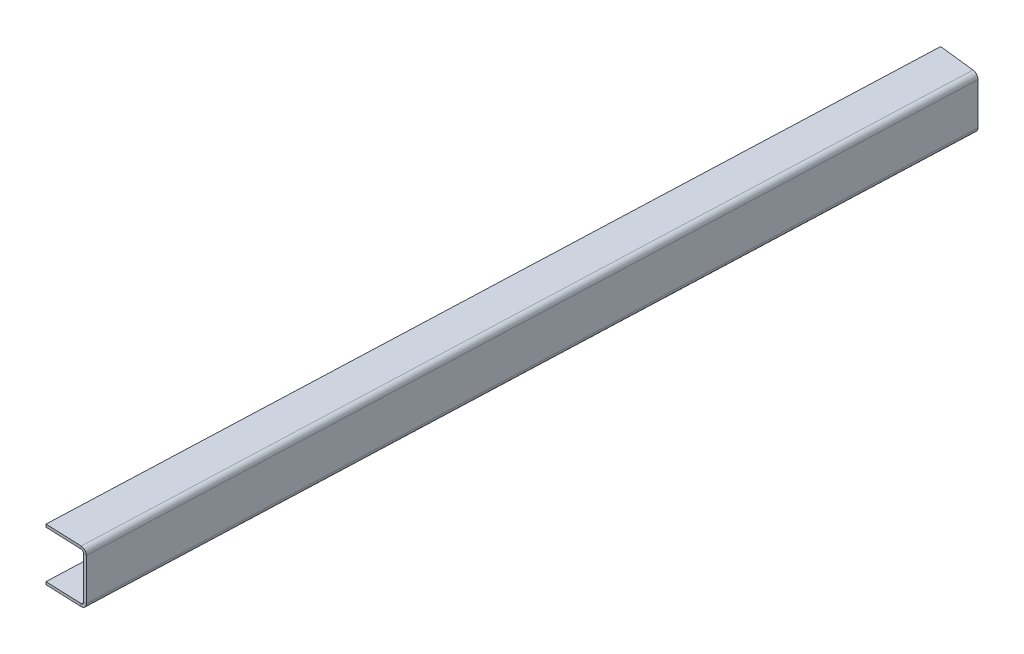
ISO-10303-21;
HEADER;
FILE_DESCRIPTION(('STEP AP214'),'2;1');
FILE_NAME('part.step','',(''),(''),'','','');
FILE_SCHEMA(('AUTOMOTIVE_DESIGN { 1 0 10303 214 1 1 1 1 }'));
ENDSEC;
DATA;
#1=APPLICATION_CONTEXT('core data for automotive mechanical design processes');
#2=APPLICATION_PROTOCOL_DEFINITION('international standard','automotive_design',2000,#1);
#3=PRODUCT_CONTEXT('',#1,'mechanical');
#4=PRODUCT('Part','Part','',(#3));
#5=PRODUCT_RELATED_PRODUCT_CATEGORY('part','',(#4));
#6=PRODUCT_DEFINITION_FORMATION('','',#4);
#7=PRODUCT_DEFINITION_CONTEXT('part definition',#1,'design');
#8=PRODUCT_DEFINITION('design','',#6,#7);
#9=PRODUCT_DEFINITION_SHAPE('','',#8);
#10=(LENGTH_UNIT() NAMED_UNIT(*) SI_UNIT(.MILLI.,.METRE.));
#11=(NAMED_UNIT(*) PLANE_ANGLE_UNIT() SI_UNIT($,.RADIAN.));
#12=(NAMED_UNIT(*) SI_UNIT($,.STERADIAN.) SOLID_ANGLE_UNIT());
#13=UNCERTAINTY_MEASURE_WITH_UNIT(LENGTH_MEASURE(1.E-05),#10,'distance_accuracy_value','');
#14=(GEOMETRIC_REPRESENTATION_CONTEXT(3) GLOBAL_UNCERTAINTY_ASSIGNED_CONTEXT((#13)) GLOBAL_UNIT_ASSIGNED_CONTEXT((#10,
#11,#12)) REPRESENTATION_CONTEXT('',''));
#15=CARTESIAN_POINT('',(0.,0.,0.));
#16=DIRECTION('',(0.,0.,1.));
#17=DIRECTION('',(1.,0.,0.));
#18=AXIS2_PLACEMENT_3D('',#15,#16,#17);
#19=CARTESIAN_POINT('',(-699.617156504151,0.,-689.099239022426));
#20=DIRECTION('',(0.0392134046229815,0.,-0.999230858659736));
#21=DIRECTION('',(0.,1.,0.));
#22=AXIS2_PLACEMENT_3D('',#19,#20,#21);
#23=PLANE('',#22);
#24=DIRECTION('',(-0.999230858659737,0.,-0.0392134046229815));
#25=VECTOR('',#24,1.);
#26=CARTESIAN_POINT('',(-699.617156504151,-28.4988000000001,-689.099239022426));
#27=LINE('',#26,#25);
#28=CARTESIAN_POINT('',(-697.992806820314,-28.4988000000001,-689.035493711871));
#29=VERTEX_POINT('',#28);
#30=CARTESIAN_POINT('',(-699.617156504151,-28.4988000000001,-689.099239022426));
#31=VERTEX_POINT('',#30);
#32=EDGE_CURVE('E12',#29,#31,#27,.T.);
#33=ORIENTED_EDGE('',*,*,#32,.F.);
#34=DIRECTION('',(0.,1.,0.));
#35=VECTOR('',#34,1.);
#36=CARTESIAN_POINT('',(-697.992806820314,0.,-689.035493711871));
#37=LINE('',#36,#35);
#38=CARTESIAN_POINT('',(-697.992806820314,-3.25120000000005,-689.035493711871));
#39=VERTEX_POINT('',#38);
#40=EDGE_CURVE('E137',#29,#39,#37,.T.);
#41=ORIENTED_EDGE('',*,*,#40,.T.);
#42=DIRECTION('',(-0.999230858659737,0.,-0.0392134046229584));
#43=VECTOR('',#42,1.);
#44=CARTESIAN_POINT('',(-699.617156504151,-3.25120000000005,-689.099239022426));
#45=LINE('',#44,#43);
#46=CARTESIAN_POINT('',(-699.617156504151,-3.25120000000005,-689.099239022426));
#47=VERTEX_POINT('',#46);
#48=EDGE_CURVE('E90',#39,#47,#45,.T.);
#49=ORIENTED_EDGE('',*,*,#48,.T.);
#50=DIRECTION('',(0.,1.,0.));
#51=VECTOR('',#50,1.);
#52=CARTESIAN_POINT('',(-699.617156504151,0.,-689.099239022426));
#53=LINE('',#52,#51);
#54=EDGE_CURVE('E139',#31,#47,#53,.T.);
#55=ORIENTED_EDGE('',*,*,#54,.F.);
#56=EDGE_LOOP('',(#33,#41,#49,#55));
#57=FACE_BOUND('',#56,.T.);
#58=ADVANCED_FACE('F78',(#57),#23,.F.);
#59=CARTESIAN_POINT('',(-702.865784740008,-3.25120000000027,-689.228542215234));
#60=CARTESIAN_POINT('',(-703.407234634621,-3.25120000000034,-689.249790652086));
#61=CARTESIAN_POINT('',(-703.948684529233,-3.25120000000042,-689.271039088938));
#62=CARTESIAN_POINT('',(-704.490134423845,-3.25120000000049,-689.29228752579));
#63=CARTESIAN_POINT('',(-702.865784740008,-6.50240000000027,-689.228542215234));
#64=CARTESIAN_POINT('',(-703.40723463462,-7.58613333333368,-689.249790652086));
#65=CARTESIAN_POINT('',(-703.948684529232,-8.66986666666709,-689.271039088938));
#66=CARTESIAN_POINT('',(-704.490134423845,-9.75360000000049,-689.29228752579));
#67=CARTESIAN_POINT('',(-699.617156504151,-6.50239999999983,-689.099239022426));
#68=CARTESIAN_POINT('',(-699.075706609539,-7.58613333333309,-689.077990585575));
#69=CARTESIAN_POINT('',(-698.534256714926,-8.66986666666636,-689.056742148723));
#70=CARTESIAN_POINT('',(-697.992806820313,-9.75359999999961,-689.035493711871));
#71=CARTESIAN_POINT('',(-699.617156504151,-3.25119999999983,-689.099239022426));
#72=CARTESIAN_POINT('',(-699.075706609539,-3.25119999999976,-689.077990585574));
#73=CARTESIAN_POINT('',(-698.534256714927,-3.25119999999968,-689.056742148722));
#74=CARTESIAN_POINT('',(-697.992806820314,-3.25119999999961,-689.035493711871));
#75=CARTESIAN_POINT('',(-699.617156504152,1.70436581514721E-13,-689.099239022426));
#76=CARTESIAN_POINT('',(-699.07570660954,1.08373333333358,-689.077990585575));
#77=CARTESIAN_POINT('',(-698.534256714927,2.16746666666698,-689.056742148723));
#78=CARTESIAN_POINT('',(-697.992806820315,3.25120000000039,-689.035493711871));
#79=CARTESIAN_POINT('',(-702.865784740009,-2.69315819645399E-13,-689.228542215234));
#80=CARTESIAN_POINT('',(-703.407234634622,1.08373333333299,-689.249790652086));
#81=CARTESIAN_POINT('',(-703.948684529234,2.16746666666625,-689.271039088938));
#82=CARTESIAN_POINT('',(-704.490134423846,3.25119999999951,-689.29228752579));
#83=CARTESIAN_POINT('',(-702.865784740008,-3.25120000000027,-689.228542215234));
#84=CARTESIAN_POINT('',(-703.407234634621,-3.25120000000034,-689.249790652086));
#85=CARTESIAN_POINT('',(-703.948684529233,-3.25120000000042,-689.271039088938));
#86=CARTESIAN_POINT('',(-704.490134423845,-3.25120000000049,-689.29228752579));
#87=(BOUNDED_SURFACE() B_SPLINE_SURFACE(3,3,((#59,#60,#61,#62),(#63,#64,#65,#66),(#67,#68,#69,
#70),(#71,#72,#73,#74),(#75,#76,#77,#78),(#79,#80,#81,#82),(#83,#84,#85,#86)),.UNSPECIFIED.,.T.,
.F.,.F.) B_SPLINE_SURFACE_WITH_KNOTS((4,3,4),(4,4),(0.,0.5,1.),(0.,1.),
.UNSPECIFIED.) GEOMETRIC_REPRESENTATION_ITEM() RATIONAL_B_SPLINE_SURFACE(((1.,1.,1.,1.),
(0.333333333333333,0.333333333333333,0.333333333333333,0.333333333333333),(0.333333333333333,
0.333333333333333,0.333333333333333,0.333333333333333),(1.,1.,1.,1.),(0.333333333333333,
0.333333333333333,0.333333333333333,0.333333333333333),(0.333333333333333,0.333333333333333,
0.333333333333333,0.333333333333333),(1.,1.,1.,1.))) REPRESENTATION_ITEM('') SURFACE());
#88=CARTESIAN_POINT('',(-701.24147062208,-3.25120000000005,-689.16389061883));
#89=DIRECTION('',(-0.0394921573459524,0.,0.999219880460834));
#90=DIRECTION('',(-0.999219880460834,-1.35258484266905E-13,-0.0394921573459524));
#91=AXIS2_PLACEMENT_3D('',#88,#89,#90);
#92=ELLIPSE('',#91,3.25120012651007,3.2512);
#93=CARTESIAN_POINT('',(-701.24147062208,0.,-689.16389061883));
#94=VERTEX_POINT('',#93);
#95=EDGE_CURVE('E215',#39,#94,#92,.T.);
#96=DIRECTION('',(0.,-1.,0.));
#97=VECTOR('',#96,1.);
#98=CARTESIAN_POINT('',(-701.24147062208,-1.62560000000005,-689.16389061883));
#99=LINE('',#98,#97);
#100=CARTESIAN_POINT('',(-701.24147062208,-1.62560000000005,-689.16389061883));
#101=VERTEX_POINT('',#100);
#102=EDGE_CURVE('E205',#94,#101,#99,.T.);
#103=CARTESIAN_POINT('',(-701.24147062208,-3.25120000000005,-689.16389061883));
#104=DIRECTION('',(-0.0397709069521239,0.,0.999208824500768));
#105=DIRECTION('',(-0.999208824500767,-1.35321803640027E-13,-0.0397709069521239));
#106=AXIS2_PLACEMENT_3D('',#103,#104,#105);
#107=ELLIPSE('',#106,1.62560025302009,1.6256);
#108=EDGE_CURVE('E213',#47,#101,#107,.T.);
#109=ORIENTED_EDGE('',*,*,#48,.F.);
#110=ORIENTED_EDGE('',*,*,#95,.T.);
#111=ORIENTED_EDGE('',*,*,#102,.T.);
#112=ORIENTED_EDGE('',*,*,#108,.F.);
#113=EDGE_LOOP('',(#109,#110,#111,#112));
#114=FACE_BOUND('',#113,.T.);
#115=ADVANCED_FACE('F212',(#114),#87,.F.);
#116=CARTESIAN_POINT('',(-723.377141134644,-1.62560000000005,-690.044943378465));
#117=DIRECTION('',(-0.0397709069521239,0.,0.999208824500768));
#118=DIRECTION('',(0.999208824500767,0.,0.0397709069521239));
#119=AXIS2_PLACEMENT_3D('',#116,#117,#118);
#120=PLANE('',#119);
#121=ORIENTED_EDGE('',*,*,#102,.F.);
#122=DIRECTION('',(0.999208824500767,0.,0.0397709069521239));
#123=VECTOR('',#122,1.);
#124=CARTESIAN_POINT('',(-723.377141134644,0.,-690.044943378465));
#125=LINE('',#124,#123);
#126=CARTESIAN_POINT('',(-723.377141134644,0.,-690.044943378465));
#127=VERTEX_POINT('',#126);
#128=EDGE_CURVE('E176',#127,#94,#125,.T.);
#129=ORIENTED_EDGE('',*,*,#128,.F.);
#130=DIRECTION('',(0.,-1.,0.));
#131=VECTOR('',#130,1.);
#132=CARTESIAN_POINT('',(-723.377141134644,-1.62560000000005,-690.044943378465));
#133=LINE('',#132,#131);
#134=CARTESIAN_POINT('',(-723.377141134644,-1.62560000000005,-690.044943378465));
#135=VERTEX_POINT('',#134);
#136=EDGE_CURVE('E202',#127,#135,#133,.T.);
#137=ORIENTED_EDGE('',*,*,#136,.T.);
#138=DIRECTION('',(0.999208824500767,0.,0.0397709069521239));
#139=VECTOR('',#138,1.);
#140=CARTESIAN_POINT('',(-723.377141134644,-1.62560000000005,-690.044943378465));
#141=LINE('',#140,#139);
#142=EDGE_CURVE('E232',#135,#101,#141,.T.);
#143=ORIENTED_EDGE('',*,*,#142,.T.);
#144=EDGE_LOOP('',(#121,#129,#137,#143));
#145=FACE_BOUND('',#144,.T.);
#146=ADVANCED_FACE('F233',(#145),#120,.T.);
#147=CARTESIAN_POINT('',(-702.947894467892,-1.62560000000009,-1210.6203406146));
#148=DIRECTION('',(-0.999230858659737,0.,-0.0392134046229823));
#149=DIRECTION('',(-0.0392134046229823,0.,0.999230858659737));
#150=AXIS2_PLACEMENT_3D('',#147,#148,#149);
#151=PLANE('',#150);
#152=ORIENTED_EDGE('',*,*,#136,.F.);
#153=DIRECTION('',(-0.0392134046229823,0.,0.999230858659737));
#154=VECTOR('',#153,1.);
#155=CARTESIAN_POINT('',(-702.947894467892,0.,-1210.6203406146));
#156=LINE('',#155,#154);
#157=CARTESIAN_POINT('',(-702.947894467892,0.,-1210.6203406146));
#158=VERTEX_POINT('',#157);
#159=EDGE_CURVE('E168',#158,#127,#156,.T.);
#160=ORIENTED_EDGE('',*,*,#159,.F.);
#161=DIRECTION('',(0.,-1.,0.));
#162=VECTOR('',#161,1.);
#163=CARTESIAN_POINT('',(-702.947894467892,-1.62560000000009,-1210.6203406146));
#164=LINE('',#163,#162);
#165=CARTESIAN_POINT('',(-702.947894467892,-1.62560000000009,-1210.6203406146));
#166=VERTEX_POINT('',#165);
#167=EDGE_CURVE('E199',#158,#166,#164,.T.);
#168=ORIENTED_EDGE('',*,*,#167,.T.);
#169=DIRECTION('',(-0.0392134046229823,0.,0.999230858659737));
#170=VECTOR('',#169,1.);
#171=CARTESIAN_POINT('',(-702.947894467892,-1.62560000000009,-1210.6203406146));
#172=LINE('',#171,#170);
#173=EDGE_CURVE('E237',#166,#135,#172,.T.);
#174=ORIENTED_EDGE('',*,*,#173,.T.);
#175=EDGE_LOOP('',(#152,#160,#168,#174));
#176=FACE_BOUND('',#175,.T.);
#177=ADVANCED_FACE('F280',(#176),#151,.T.);
#178=CARTESIAN_POINT('',(-677.64081354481,-1.62560000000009,-1207.75438699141));
#179=DIRECTION('',(0.112527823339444,0.,-0.993648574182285));
#180=DIRECTION('',(-0.993648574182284,0.,-0.112527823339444));
#181=AXIS2_PLACEMENT_3D('',#178,#179,#180);
#182=PLANE('',#181);
#183=ORIENTED_EDGE('',*,*,#167,.F.);
#184=DIRECTION('',(-0.993648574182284,0.,-0.112527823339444));
#185=VECTOR('',#184,1.);
#186=CARTESIAN_POINT('',(-677.64081354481,0.,-1207.75438699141));
#187=LINE('',#186,#185);
#188=CARTESIAN_POINT('',(-680.875741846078,0.,-1208.12073325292));
#189=VERTEX_POINT('',#188);
#190=EDGE_CURVE('E173',#189,#158,#187,.T.);
#191=ORIENTED_EDGE('',*,*,#190,.F.);
#192=DIRECTION('',(0.,-1.,0.));
#193=VECTOR('',#192,1.);
#194=CARTESIAN_POINT('',(-680.875741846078,-1.62560000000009,-1208.12073325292));
#195=LINE('',#194,#193);
#196=CARTESIAN_POINT('',(-680.875741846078,-1.62560000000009,-1208.12073325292));
#197=VERTEX_POINT('',#196);
#198=EDGE_CURVE('E196',#189,#197,#195,.T.);
#199=ORIENTED_EDGE('',*,*,#198,.T.);
#200=DIRECTION('',(-0.993648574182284,0.,-0.112527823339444));
#201=VECTOR('',#200,1.);
#202=CARTESIAN_POINT('',(-677.64081354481,-1.62560000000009,-1207.75438699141));
#203=LINE('',#202,#201);
#204=EDGE_CURVE('E238',#197,#166,#203,.T.);
#205=ORIENTED_EDGE('',*,*,#204,.T.);
#206=EDGE_LOOP('',(#183,#191,#199,#205));
#207=FACE_BOUND('',#206,.T.);
#208=ADVANCED_FACE('F307',(#207),#182,.T.);
#209=CARTESIAN_POINT('',(-682.495395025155,-3.25120000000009,-1208.3041542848));
#210=CARTESIAN_POINT('',(-683.036844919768,-3.25120000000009,-1208.32540272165));
#211=CARTESIAN_POINT('',(-683.57829481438,-3.25120000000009,-1208.3466511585));
#212=CARTESIAN_POINT('',(-684.119744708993,-3.25120000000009,-1208.36789959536));
#213=CARTESIAN_POINT('',(-682.495395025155,0.,-1208.3041542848));
#214=CARTESIAN_POINT('',(-683.036844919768,1.08373333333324,-1208.32540272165));
#215=CARTESIAN_POINT('',(-683.578294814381,2.16746666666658,-1208.3466511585));
#216=CARTESIAN_POINT('',(-684.119744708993,3.25119999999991,-1208.36789959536));
#217=CARTESIAN_POINT('',(-679.256088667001,0.,-1207.93731222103));
#218=CARTESIAN_POINT('',(-678.714638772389,1.08373333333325,-1207.91606378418));
#219=CARTESIAN_POINT('',(-678.173188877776,2.16746666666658,-1207.89481534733));
#220=CARTESIAN_POINT('',(-677.631738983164,3.25119999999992,-1207.87356691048));
#221=CARTESIAN_POINT('',(-679.256088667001,-3.25120000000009,-1207.93731222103));
#222=CARTESIAN_POINT('',(-678.714638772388,-3.25120000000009,-1207.91606378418));
#223=CARTESIAN_POINT('',(-678.173188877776,-3.25120000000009,-1207.89481534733));
#224=CARTESIAN_POINT('',(-677.631738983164,-3.25120000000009,-1207.87356691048));
#225=CARTESIAN_POINT('',(-679.256088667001,-6.50240000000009,-1207.93731222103));
#226=CARTESIAN_POINT('',(-678.714638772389,-7.58613333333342,-1207.91606378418));
#227=CARTESIAN_POINT('',(-678.173188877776,-8.66986666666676,-1207.89481534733));
#228=CARTESIAN_POINT('',(-677.631738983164,-9.75360000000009,-1207.87356691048));
#229=CARTESIAN_POINT('',(-682.495395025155,-6.50240000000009,-1208.3041542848));
#230=CARTESIAN_POINT('',(-683.036844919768,-7.58613333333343,-1208.32540272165));
#231=CARTESIAN_POINT('',(-683.578294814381,-8.66986666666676,-1208.3466511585));
#232=CARTESIAN_POINT('',(-684.119744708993,-9.75360000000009,-1208.36789959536));
#233=CARTESIAN_POINT('',(-682.495395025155,-3.25120000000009,-1208.3041542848));
#234=CARTESIAN_POINT('',(-683.036844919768,-3.25120000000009,-1208.32540272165));
#235=CARTESIAN_POINT('',(-683.57829481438,-3.25120000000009,-1208.3466511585));
#236=CARTESIAN_POINT('',(-684.119744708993,-3.25120000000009,-1208.36789959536));
#237=(BOUNDED_SURFACE() B_SPLINE_SURFACE(3,3,((#209,#210,#211,#212),(#213,#214,#215,#216),(#217,
#218,#219,#220),(#221,#222,#223,#224),(#225,#226,#227,#228),(#229,#230,#231,#232),(#233,#234,
#235,#236)),.UNSPECIFIED.,.T.,.F.,.F.) B_SPLINE_SURFACE_WITH_KNOTS((4,3,4),(4,4),(0.,0.5,1.),
(0.,1.),.UNSPECIFIED.) GEOMETRIC_REPRESENTATION_ITEM() RATIONAL_B_SPLINE_SURFACE(((1.,1.,1.,1.),
(0.333333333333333,0.333333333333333,0.333333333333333,0.333333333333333),(0.333333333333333,
0.333333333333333,0.333333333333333,0.333333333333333),(1.,1.,1.,1.),(0.333333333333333,
0.333333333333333,0.333333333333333,0.333333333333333),(0.333333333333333,0.333333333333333,
0.333333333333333,0.333333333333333),(1.,1.,1.,1.))) REPRESENTATION_ITEM('') SURFACE());
#238=CARTESIAN_POINT('',(-680.875741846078,-3.25120000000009,-1208.12073325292));
#239=DIRECTION('',(0.0759715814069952,0.,-0.997109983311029));
#240=DIRECTION('',(-0.997109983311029,0.,-0.0759715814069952));
#241=AXIS2_PLACEMENT_3D('',#238,#239,#240);
#242=ELLIPSE('',#241,3.25340525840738,3.2512);
#243=CARTESIAN_POINT('',(-677.631738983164,-3.25120000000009,-1207.87356691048));
#244=VERTEX_POINT('',#243);
#245=EDGE_CURVE('E178',#189,#244,#242,.T.);
#246=DIRECTION('',(-0.999230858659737,0.,-0.0392134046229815));
#247=VECTOR('',#246,1.);
#248=CARTESIAN_POINT('',(-679.256088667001,-3.25120000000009,-1207.93731222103));
#249=LINE('',#248,#247);
#250=CARTESIAN_POINT('',(-679.256088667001,-3.25120000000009,-1207.93731222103));
#251=VERTEX_POINT('',#250);
#252=EDGE_CURVE('E194',#244,#251,#249,.T.);
#253=CARTESIAN_POINT('',(-680.875741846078,-3.25120000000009,-1208.12073325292));
#254=DIRECTION('',(0.112527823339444,0.,-0.993648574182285));
#255=DIRECTION('',(-0.993648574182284,0.,-0.112527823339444));
#256=AXIS2_PLACEMENT_3D('',#253,#254,#255);
#257=ELLIPSE('',#256,1.63000604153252,1.6256);
#258=EDGE_CURVE('E229',#197,#251,#257,.T.);
#259=ORIENTED_EDGE('',*,*,#198,.F.);
#260=ORIENTED_EDGE('',*,*,#245,.T.);
#261=ORIENTED_EDGE('',*,*,#252,.T.);
#262=ORIENTED_EDGE('',*,*,#258,.F.);
#263=EDGE_LOOP('',(#259,#260,#261,#262));
#264=FACE_BOUND('',#263,.T.);
#265=ADVANCED_FACE('F357',(#264),#237,.F.);
#266=CARTESIAN_POINT('',(-679.256088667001,0.,-1207.93731222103));
#267=DIRECTION('',(-0.0392134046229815,0.,0.999230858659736));
#268=DIRECTION('',(0.,-1.,0.));
#269=AXIS2_PLACEMENT_3D('',#266,#267,#268);
#270=PLANE('',#269);
#271=ORIENTED_EDGE('',*,*,#252,.F.);
#272=DIRECTION('',(0.,1.,0.));
#273=VECTOR('',#272,1.);
#274=CARTESIAN_POINT('',(-677.631738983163,0.,-1207.87356691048));
#275=LINE('',#274,#273);
#276=CARTESIAN_POINT('',(-677.631738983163,-28.4988000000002,-1207.87356691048));
#277=VERTEX_POINT('',#276);
#278=EDGE_CURVE('E167',#244,#277,#275,.F.);
#279=ORIENTED_EDGE('',*,*,#278,.T.);
#280=DIRECTION('',(-0.999230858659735,0.,-0.0392134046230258));
#281=VECTOR('',#280,1.);
#282=CARTESIAN_POINT('',(-679.256088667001,-28.4988000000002,-1207.93731222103));
#283=LINE('',#282,#281);
#284=CARTESIAN_POINT('',(-679.256088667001,-28.4988000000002,-1207.93731222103));
#285=VERTEX_POINT('',#284);
#286=EDGE_CURVE('E191',#277,#285,#283,.T.);
#287=ORIENTED_EDGE('',*,*,#286,.T.);
#288=DIRECTION('',(0.,-1.,0.));
#289=VECTOR('',#288,1.);
#290=CARTESIAN_POINT('',(-679.256088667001,0.,-1207.93731222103));
#291=LINE('',#290,#289);
#292=EDGE_CURVE('E284',#251,#285,#291,.T.);
#293=ORIENTED_EDGE('',*,*,#292,.F.);
#294=EDGE_LOOP('',(#271,#279,#287,#293));
#295=FACE_BOUND('',#294,.T.);
#296=ADVANCED_FACE('F322',(#295),#270,.F.);
#297=CARTESIAN_POINT('',(-679.256088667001,-28.4988000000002,-1207.93731222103));
#298=CARTESIAN_POINT('',(-678.714638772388,-28.4988000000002,-1207.91606378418));
#299=CARTESIAN_POINT('',(-678.173188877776,-28.4988000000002,-1207.89481534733));
#300=CARTESIAN_POINT('',(-677.631738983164,-28.4988000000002,-1207.87356691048));
#301=CARTESIAN_POINT('',(-679.256088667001,-31.7500000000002,-1207.93731222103));
#302=CARTESIAN_POINT('',(-678.714638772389,-32.8337333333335,-1207.91606378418));
#303=CARTESIAN_POINT('',(-678.173188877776,-33.9174666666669,-1207.89481534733));
#304=CARTESIAN_POINT('',(-677.631738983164,-35.0012000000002,-1207.87356691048));
#305=CARTESIAN_POINT('',(-682.495395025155,-31.7500000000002,-1208.3041542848));
#306=CARTESIAN_POINT('',(-683.036844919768,-32.8337333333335,-1208.32540272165));
#307=CARTESIAN_POINT('',(-683.578294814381,-33.9174666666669,-1208.3466511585));
#308=CARTESIAN_POINT('',(-684.119744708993,-35.0012000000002,-1208.36789959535));
#309=CARTESIAN_POINT('',(-682.495395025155,-28.4988000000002,-1208.3041542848));
#310=CARTESIAN_POINT('',(-683.036844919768,-28.4988000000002,-1208.32540272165));
#311=CARTESIAN_POINT('',(-683.57829481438,-28.4988000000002,-1208.3466511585));
#312=CARTESIAN_POINT('',(-684.119744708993,-28.4988000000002,-1208.36789959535));
#313=CARTESIAN_POINT('',(-682.495395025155,-25.2476000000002,-1208.3041542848));
#314=CARTESIAN_POINT('',(-683.036844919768,-24.1638666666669,-1208.32540272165));
#315=CARTESIAN_POINT('',(-683.578294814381,-23.0801333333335,-1208.3466511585));
#316=CARTESIAN_POINT('',(-684.119744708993,-21.9964000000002,-1208.36789959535));
#317=CARTESIAN_POINT('',(-679.256088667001,-25.2476000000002,-1207.93731222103));
#318=CARTESIAN_POINT('',(-678.714638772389,-24.1638666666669,-1207.91606378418));
#319=CARTESIAN_POINT('',(-678.173188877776,-23.0801333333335,-1207.89481534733));
#320=CARTESIAN_POINT('',(-677.631738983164,-21.9964000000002,-1207.87356691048));
#321=CARTESIAN_POINT('',(-679.256088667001,-28.4988000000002,-1207.93731222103));
#322=CARTESIAN_POINT('',(-678.714638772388,-28.4988000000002,-1207.91606378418));
#323=CARTESIAN_POINT('',(-678.173188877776,-28.4988000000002,-1207.89481534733));
#324=CARTESIAN_POINT('',(-677.631738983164,-28.4988000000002,-1207.87356691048));
#325=(BOUNDED_SURFACE() B_SPLINE_SURFACE(3,3,((#297,#298,#299,#300),(#301,#302,#303,#304),(#305,
#306,#307,#308),(#309,#310,#311,#312),(#313,#314,#315,#316),(#317,#318,#319,#320),(#321,#322,
#323,#324)),.UNSPECIFIED.,.T.,.F.,.F.) B_SPLINE_SURFACE_WITH_KNOTS((4,3,4),(4,4),(0.,0.5,1.),
(0.,1.),.UNSPECIFIED.) GEOMETRIC_REPRESENTATION_ITEM() RATIONAL_B_SPLINE_SURFACE(((1.,1.,1.,1.),
(0.333333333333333,0.333333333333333,0.333333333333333,0.333333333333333),(0.333333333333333,
0.333333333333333,0.333333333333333,0.333333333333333),(1.,1.,1.,1.),(0.333333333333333,
0.333333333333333,0.333333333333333,0.333333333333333),(0.333333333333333,0.333333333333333,
0.333333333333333,0.333333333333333),(1.,1.,1.,1.))) REPRESENTATION_ITEM('') SURFACE());
#326=CARTESIAN_POINT('',(-680.875741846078,-28.4988000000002,-1208.12073325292));
#327=DIRECTION('',(0.0759715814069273,0.,-0.997109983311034));
#328=DIRECTION('',(0.997109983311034,0.,0.0759715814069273));
#329=AXIS2_PLACEMENT_3D('',#326,#327,#328);
#330=ELLIPSE('',#329,3.25340525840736,3.2512);
#331=CARTESIAN_POINT('',(-680.875741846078,-31.7500000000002,-1208.12073325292));
#332=VERTEX_POINT('',#331);
#333=EDGE_CURVE('E155',#277,#332,#330,.T.);
#334=DIRECTION('',(0.,1.,0.));
#335=VECTOR('',#334,1.);
#336=CARTESIAN_POINT('',(-680.875741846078,-30.1244000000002,-1208.12073325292));
#337=LINE('',#336,#335);
#338=CARTESIAN_POINT('',(-680.875741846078,-30.1244000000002,-1208.12073325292));
#339=VERTEX_POINT('',#338);
#340=EDGE_CURVE('E188',#332,#339,#337,.T.);
#341=CARTESIAN_POINT('',(-680.875741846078,-28.4988000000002,-1208.12073325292));
#342=DIRECTION('',(0.112527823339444,0.,-0.993648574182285));
#343=DIRECTION('',(0.993648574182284,0.,0.112527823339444));
#344=AXIS2_PLACEMENT_3D('',#341,#342,#343);
#345=ELLIPSE('',#344,1.63000604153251,1.6256);
#346=EDGE_CURVE('E254',#285,#339,#345,.T.);
#347=ORIENTED_EDGE('',*,*,#286,.F.);
#348=ORIENTED_EDGE('',*,*,#333,.T.);
#349=ORIENTED_EDGE('',*,*,#340,.T.);
#350=ORIENTED_EDGE('',*,*,#346,.F.);
#351=EDGE_LOOP('',(#347,#348,#349,#350));
#352=FACE_BOUND('',#351,.T.);
#353=ADVANCED_FACE('F326',(#352),#325,.F.);
#354=CARTESIAN_POINT('',(-702.947894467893,-30.1244000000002,-1210.6203406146));
#355=DIRECTION('',(0.112527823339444,0.,-0.993648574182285));
#356=DIRECTION('',(0.993648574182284,0.,0.112527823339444));
#357=AXIS2_PLACEMENT_3D('',#354,#355,#356);
#358=PLANE('',#357);
#359=ORIENTED_EDGE('',*,*,#340,.F.);
#360=DIRECTION('',(0.993648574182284,0.,0.112527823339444));
#361=VECTOR('',#360,1.);
#362=CARTESIAN_POINT('',(-702.947894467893,-31.7500000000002,-1210.6203406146));
#363=LINE('',#362,#361);
#364=CARTESIAN_POINT('',(-702.947894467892,-31.7500000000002,-1210.6203406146));
#365=VERTEX_POINT('',#364);
#366=EDGE_CURVE('E262',#365,#332,#363,.T.);
#367=ORIENTED_EDGE('',*,*,#366,.F.);
#368=DIRECTION('',(0.,1.,0.));
#369=VECTOR('',#368,1.);
#370=CARTESIAN_POINT('',(-702.947894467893,-30.1244000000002,-1210.6203406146));
#371=LINE('',#370,#369);
#372=CARTESIAN_POINT('',(-702.947894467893,-30.1244000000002,-1210.6203406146));
#373=VERTEX_POINT('',#372);
#374=EDGE_CURVE('E185',#365,#373,#371,.T.);
#375=ORIENTED_EDGE('',*,*,#374,.T.);
#376=DIRECTION('',(0.993648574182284,0.,0.112527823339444));
#377=VECTOR('',#376,1.);
#378=CARTESIAN_POINT('',(-702.947894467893,-30.1244000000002,-1210.6203406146));
#379=LINE('',#378,#377);
#380=EDGE_CURVE('E293',#373,#339,#379,.T.);
#381=ORIENTED_EDGE('',*,*,#380,.T.);
#382=EDGE_LOOP('',(#359,#367,#375,#381));
#383=FACE_BOUND('',#382,.T.);
#384=ADVANCED_FACE('F374',(#383),#358,.T.);
#385=CARTESIAN_POINT('',(-723.377141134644,-30.1244000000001,-690.044943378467));
#386=DIRECTION('',(-0.999230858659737,0.,-0.0392134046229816));
#387=DIRECTION('',(0.0392134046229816,0.,-0.999230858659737));
#388=AXIS2_PLACEMENT_3D('',#385,#386,#387);
#389=PLANE('',#388);
#390=ORIENTED_EDGE('',*,*,#374,.F.);
#391=DIRECTION('',(0.0392134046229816,0.,-0.999230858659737));
#392=VECTOR('',#391,1.);
#393=CARTESIAN_POINT('',(-723.377141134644,-31.7500000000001,-690.044943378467));
#394=LINE('',#393,#392);
#395=CARTESIAN_POINT('',(-723.377141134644,-31.7500000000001,-690.044943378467));
#396=VERTEX_POINT('',#395);
#397=EDGE_CURVE('E255',#396,#365,#394,.T.);
#398=ORIENTED_EDGE('',*,*,#397,.F.);
#399=DIRECTION('',(0.,1.,0.));
#400=VECTOR('',#399,1.);
#401=CARTESIAN_POINT('',(-723.377141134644,-30.1244000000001,-690.044943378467));
#402=LINE('',#401,#400);
#403=CARTESIAN_POINT('',(-723.377141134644,-30.1244000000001,-690.044943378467));
#404=VERTEX_POINT('',#403);
#405=EDGE_CURVE('E182',#396,#404,#402,.T.);
#406=ORIENTED_EDGE('',*,*,#405,.T.);
#407=DIRECTION('',(0.0392134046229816,0.,-0.999230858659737));
#408=VECTOR('',#407,1.);
#409=CARTESIAN_POINT('',(-723.377141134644,-30.1244000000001,-690.044943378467));
#410=LINE('',#409,#408);
#411=EDGE_CURVE('E296',#404,#373,#410,.T.);
#412=ORIENTED_EDGE('',*,*,#411,.T.);
#413=EDGE_LOOP('',(#390,#398,#406,#412));
#414=FACE_BOUND('',#413,.T.);
#415=ADVANCED_FACE('F382',(#414),#389,.T.);
#416=CARTESIAN_POINT('',(-697.997233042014,-30.1244000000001,-689.034762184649));
#417=DIRECTION('',(-0.0397709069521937,0.,0.999208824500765));
#418=DIRECTION('',(-0.999208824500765,0.,-0.0397709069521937));
#419=AXIS2_PLACEMENT_3D('',#416,#417,#418);
#420=PLANE('',#419);
#421=ORIENTED_EDGE('',*,*,#405,.F.);
#422=DIRECTION('',(-0.999208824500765,0.,-0.0397709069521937));
#423=VECTOR('',#422,1.);
#424=CARTESIAN_POINT('',(-697.997233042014,-31.7500000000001,-689.034762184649));
#425=LINE('',#424,#423);
#426=CARTESIAN_POINT('',(-701.241470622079,-31.7500000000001,-689.16389061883));
#427=VERTEX_POINT('',#426);
#428=EDGE_CURVE('E259',#427,#396,#425,.T.);
#429=ORIENTED_EDGE('',*,*,#428,.F.);
#430=DIRECTION('',(0.,1.,0.));
#431=VECTOR('',#430,1.);
#432=CARTESIAN_POINT('',(-701.24147062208,-30.1244000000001,-689.16389061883));
#433=LINE('',#432,#431);
#434=CARTESIAN_POINT('',(-701.24147062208,-30.1244000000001,-689.16389061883));
#435=VERTEX_POINT('',#434);
#436=EDGE_CURVE('E84',#427,#435,#433,.T.);
#437=ORIENTED_EDGE('',*,*,#436,.T.);
#438=DIRECTION('',(-0.999208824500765,0.,-0.0397709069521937));
#439=VECTOR('',#438,1.);
#440=CARTESIAN_POINT('',(-697.997233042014,-30.1244000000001,-689.034762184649));
#441=LINE('',#440,#439);
#442=EDGE_CURVE('E290',#435,#404,#441,.T.);
#443=ORIENTED_EDGE('',*,*,#442,.T.);
#444=EDGE_LOOP('',(#421,#429,#437,#443));
#445=FACE_BOUND('',#444,.T.);
#446=ADVANCED_FACE('F386',(#445),#420,.T.);
#447=CARTESIAN_POINT('',(-699.617156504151,-28.4987999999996,-689.099239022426));
#448=CARTESIAN_POINT('',(-699.075706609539,-28.4987999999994,-689.077990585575));
#449=CARTESIAN_POINT('',(-698.534256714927,-28.4987999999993,-689.056742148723));
#450=CARTESIAN_POINT('',(-697.992806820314,-28.4987999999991,-689.035493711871));
#451=CARTESIAN_POINT('',(-699.617156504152,-25.2475999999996,-689.099239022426));
#452=CARTESIAN_POINT('',(-699.075706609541,-24.1638666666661,-689.077990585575));
#453=CARTESIAN_POINT('',(-698.534256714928,-23.0801333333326,-689.056742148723));
#454=CARTESIAN_POINT('',(-697.992806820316,-21.9963999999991,-689.035493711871));
#455=CARTESIAN_POINT('',(-702.865784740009,-25.2476000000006,-689.228542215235));
#456=CARTESIAN_POINT('',(-703.407234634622,-24.1638666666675,-689.249790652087));
#457=CARTESIAN_POINT('',(-703.948684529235,-23.0801333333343,-689.271039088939));
#458=CARTESIAN_POINT('',(-704.490134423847,-21.9964000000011,-689.29228752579));
#459=CARTESIAN_POINT('',(-702.865784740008,-28.4988000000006,-689.228542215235));
#460=CARTESIAN_POINT('',(-703.40723463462,-28.4988000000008,-689.249790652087));
#461=CARTESIAN_POINT('',(-703.948684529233,-28.498800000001,-689.271039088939));
#462=CARTESIAN_POINT('',(-704.490134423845,-28.4988000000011,-689.29228752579));
#463=CARTESIAN_POINT('',(-702.865784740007,-31.7500000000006,-689.228542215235));
#464=CARTESIAN_POINT('',(-703.407234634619,-32.8337333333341,-689.249790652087));
#465=CARTESIAN_POINT('',(-703.948684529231,-33.9174666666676,-689.271039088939));
#466=CARTESIAN_POINT('',(-704.490134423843,-35.0012000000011,-689.29228752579));
#467=CARTESIAN_POINT('',(-699.61715650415,-31.7499999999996,-689.099239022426));
#468=CARTESIAN_POINT('',(-699.075706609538,-32.8337333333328,-689.077990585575));
#469=CARTESIAN_POINT('',(-698.534256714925,-33.9174666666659,-689.056742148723));
#470=CARTESIAN_POINT('',(-697.992806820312,-35.0011999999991,-689.035493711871));
#471=CARTESIAN_POINT('',(-699.617156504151,-28.4987999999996,-689.099239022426));
#472=CARTESIAN_POINT('',(-699.075706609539,-28.4987999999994,-689.077990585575));
#473=CARTESIAN_POINT('',(-698.534256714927,-28.4987999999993,-689.056742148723));
#474=CARTESIAN_POINT('',(-697.992806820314,-28.4987999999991,-689.035493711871));
#475=(BOUNDED_SURFACE() B_SPLINE_SURFACE(3,3,((#447,#448,#449,#450),(#451,#452,#453,#454),(#455,
#456,#457,#458),(#459,#460,#461,#462),(#463,#464,#465,#466),(#467,#468,#469,#470),(#471,#472,
#473,#474)),.UNSPECIFIED.,.T.,.F.,.F.) B_SPLINE_SURFACE_WITH_KNOTS((4,3,4),(4,4),(0.,0.5,1.),
(0.,1.),.UNSPECIFIED.) GEOMETRIC_REPRESENTATION_ITEM() RATIONAL_B_SPLINE_SURFACE(((1.,1.,1.,1.),
(0.333333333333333,0.333333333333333,0.333333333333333,0.333333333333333),(0.333333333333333,
0.333333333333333,0.333333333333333,0.333333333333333),(1.,1.,1.,1.),(0.333333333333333,
0.333333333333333,0.333333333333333,0.333333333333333),(0.333333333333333,0.333333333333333,
0.333333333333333,0.333333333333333),(1.,1.,1.,1.))) REPRESENTATION_ITEM('') SURFACE());
#476=CARTESIAN_POINT('',(-701.24147062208,-28.4988000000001,-689.163890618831));
#477=DIRECTION('',(-0.0394921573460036,0.,0.999219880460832));
#478=DIRECTION('',(0.999219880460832,3.11601399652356E-13,0.0394921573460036));
#479=AXIS2_PLACEMENT_3D('',#476,#477,#478);
#480=ELLIPSE('',#479,3.25120012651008,3.2512);
#481=EDGE_CURVE('E152',#427,#29,#480,.T.);
#482=CARTESIAN_POINT('',(-701.24147062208,-28.4988000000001,-689.163890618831));
#483=DIRECTION('',(-0.0397709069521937,0.,0.999208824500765));
#484=DIRECTION('',(0.999208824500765,3.1144485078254E-13,0.0397709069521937));
#485=AXIS2_PLACEMENT_3D('',#482,#483,#484);
#486=ELLIPSE('',#485,1.62560025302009,1.6256);
#487=EDGE_CURVE('E250',#435,#31,#486,.T.);
#488=ORIENTED_EDGE('',*,*,#481,.T.);
#489=ORIENTED_EDGE('',*,*,#32,.T.);
#490=ORIENTED_EDGE('',*,*,#487,.F.);
#491=ORIENTED_EDGE('',*,*,#436,.F.);
#492=EDGE_LOOP('',(#488,#489,#490,#491));
#493=FACE_BOUND('',#492,.T.);
#494=ADVANCED_FACE('F80',(#493),#475,.F.);
#495=CARTESIAN_POINT('',(0.,-30.1244,0.));
#496=DIRECTION('',(0.,-1.,0.));
#497=DIRECTION('',(0.,0.,-1.));
#498=AXIS2_PLACEMENT_3D('',#495,#496,#497);
#499=PLANE('',#498);
#500=ORIENTED_EDGE('',*,*,#442,.F.);
#501=DIRECTION('',(0.0392134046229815,0.,-0.999230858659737));
#502=VECTOR('',#501,1.);
#503=CARTESIAN_POINT('',(-680.880438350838,-30.1244000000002,-1208.00105753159));
#504=LINE('',#503,#502);
#505=EDGE_CURVE('E247',#435,#339,#504,.T.);
#506=ORIENTED_EDGE('',*,*,#505,.T.);
#507=ORIENTED_EDGE('',*,*,#380,.F.);
#508=ORIENTED_EDGE('',*,*,#411,.F.);
#509=EDGE_LOOP('',(#500,#506,#507,#508));
#510=FACE_BOUND('',#509,.T.);
#511=ADVANCED_FACE('F411',(#510),#499,.F.);
#512=CARTESIAN_POINT('',(-725.540163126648,0.,-28.5325676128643));
#513=DIRECTION('',(0.999230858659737,0.,0.0392134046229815));
#514=DIRECTION('',(0.0392134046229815,0.,-0.999230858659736));
#515=AXIS2_PLACEMENT_3D('',#512,#513,#514);
#516=PLANE('',#515);
#517=ORIENTED_EDGE('',*,*,#54,.T.);
#518=DIRECTION('',(-0.0392134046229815,0.,0.999230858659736));
#519=VECTOR('',#518,1.);
#520=CARTESIAN_POINT('',(-679.256088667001,-3.25120000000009,-1207.93731222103));
#521=LINE('',#520,#519);
#522=EDGE_CURVE('E228',#47,#251,#521,.F.);
#523=ORIENTED_EDGE('',*,*,#522,.T.);
#524=ORIENTED_EDGE('',*,*,#292,.T.);
#525=DIRECTION('',(0.0392134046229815,0.,-0.999230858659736));
#526=VECTOR('',#525,1.);
#527=CARTESIAN_POINT('',(-699.617156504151,-28.4988000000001,-689.099239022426));
#528=LINE('',#527,#526);
#529=EDGE_CURVE('E244',#285,#31,#528,.F.);
#530=ORIENTED_EDGE('',*,*,#529,.T.);
#531=EDGE_LOOP('',(#517,#523,#524,#530));
#532=FACE_BOUND('',#531,.T.);
#533=ADVANCED_FACE('F325',(#532),#516,.F.);
#534=CARTESIAN_POINT('',(0.,-1.6256,0.));
#535=DIRECTION('',(0.,1.,0.));
#536=DIRECTION('',(0.,0.,1.));
#537=AXIS2_PLACEMENT_3D('',#534,#535,#536);
#538=PLANE('',#537);
#539=ORIENTED_EDGE('',*,*,#204,.F.);
#540=DIRECTION('',(-0.0392134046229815,0.,0.999230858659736));
#541=VECTOR('',#540,1.);
#542=CARTESIAN_POINT('',(-701.241506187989,-1.62560000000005,-689.162984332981));
#543=LINE('',#542,#541);
#544=EDGE_CURVE('E226',#197,#101,#543,.T.);
#545=ORIENTED_EDGE('',*,*,#544,.T.);
#546=ORIENTED_EDGE('',*,*,#142,.F.);
#547=ORIENTED_EDGE('',*,*,#173,.F.);
#548=EDGE_LOOP('',(#539,#545,#546,#547));
#549=FACE_BOUND('',#548,.T.);
#550=ADVANCED_FACE('F241',(#549),#538,.F.);
#551=CARTESIAN_POINT('',(-727.166854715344,-28.4988,-28.5366368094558));
#552=DIRECTION('',(-0.0392134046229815,0.,0.999230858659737));
#553=DIRECTION('',(0.999230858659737,0.,0.0392134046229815));
#554=AXIS2_PLACEMENT_3D('',#551,#552,#553);
#555=CYLINDRICAL_SURFACE('',#554,1.6256);
#556=ORIENTED_EDGE('',*,*,#487,.T.);
#557=ORIENTED_EDGE('',*,*,#529,.F.);
#558=ORIENTED_EDGE('',*,*,#346,.T.);
#559=ORIENTED_EDGE('',*,*,#505,.F.);
#560=EDGE_LOOP('',(#556,#557,#558,#559));
#561=FACE_BOUND('',#560,.T.);
#562=ADVANCED_FACE('F327',(#561),#555,.F.);
#563=CARTESIAN_POINT('',(-727.166854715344,-3.2512,-28.5366368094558));
#564=DIRECTION('',(0.0392134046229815,0.,-0.999230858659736));
#565=DIRECTION('',(-0.999230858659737,0.,-0.0392134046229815));
#566=AXIS2_PLACEMENT_3D('',#563,#564,#565);
#567=CYLINDRICAL_SURFACE('',#566,1.6256);
#568=ORIENTED_EDGE('',*,*,#258,.T.);
#569=ORIENTED_EDGE('',*,*,#522,.F.);
#570=ORIENTED_EDGE('',*,*,#108,.T.);
#571=ORIENTED_EDGE('',*,*,#544,.F.);
#572=EDGE_LOOP('',(#568,#569,#570,#571));
#573=FACE_BOUND('',#572,.T.);
#574=ADVANCED_FACE('F224',(#573),#567,.F.);
#575=CARTESIAN_POINT('',(0.,-31.75,0.));
#576=DIRECTION('',(0.,-1.,0.));
#577=DIRECTION('',(0.,0.,-1.));
#578=AXIS2_PLACEMENT_3D('',#575,#576,#577);
#579=PLANE('',#578);
#580=ORIENTED_EDGE('',*,*,#428,.T.);
#581=ORIENTED_EDGE('',*,*,#397,.T.);
#582=ORIENTED_EDGE('',*,*,#366,.T.);
#583=DIRECTION('',(-0.0392134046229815,0.,0.999230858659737));
#584=VECTOR('',#583,1.);
#585=CARTESIAN_POINT('',(-727.166854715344,-31.75,-28.5366368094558));
#586=LINE('',#585,#584);
#587=EDGE_CURVE('E160',#427,#332,#586,.F.);
#588=ORIENTED_EDGE('',*,*,#587,.F.);
#589=EDGE_LOOP('',(#580,#581,#582,#588));
#590=FACE_BOUND('',#589,.T.);
#591=ADVANCED_FACE('F334',(#590),#579,.T.);
#592=CARTESIAN_POINT('',(-723.91581344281,0.,-28.4688223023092));
#593=DIRECTION('',(0.999230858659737,0.,0.0392134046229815));
#594=DIRECTION('',(0.0392134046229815,0.,-0.999230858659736));
#595=AXIS2_PLACEMENT_3D('',#592,#593,#594);
#596=PLANE('',#595);
#597=ORIENTED_EDGE('',*,*,#40,.F.);
#598=DIRECTION('',(0.0392134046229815,0.,-0.999230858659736));
#599=VECTOR('',#598,1.);
#600=CARTESIAN_POINT('',(-723.91581344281,-28.4988000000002,-28.4688223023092));
#601=LINE('',#600,#599);
#602=EDGE_CURVE('E149',#277,#29,#601,.F.);
#603=ORIENTED_EDGE('',*,*,#602,.F.);
#604=ORIENTED_EDGE('',*,*,#278,.F.);
#605=DIRECTION('',(0.0392134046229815,0.,-0.999230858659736));
#606=VECTOR('',#605,1.);
#607=CARTESIAN_POINT('',(-723.91581344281,-3.25120000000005,-28.4688223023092));
#608=LINE('',#607,#606);
#609=EDGE_CURVE('E165',#39,#244,#608,.T.);
#610=ORIENTED_EDGE('',*,*,#609,.F.);
#611=EDGE_LOOP('',(#597,#603,#604,#610));
#612=FACE_BOUND('',#611,.T.);
#613=ADVANCED_FACE('F163',(#612),#596,.T.);
#614=CARTESIAN_POINT('',(0.,0.,0.));
#615=DIRECTION('',(0.,1.,0.));
#616=DIRECTION('',(0.,0.,1.));
#617=AXIS2_PLACEMENT_3D('',#614,#615,#616);
#618=PLANE('',#617);
#619=ORIENTED_EDGE('',*,*,#190,.T.);
#620=ORIENTED_EDGE('',*,*,#159,.T.);
#621=ORIENTED_EDGE('',*,*,#128,.T.);
#622=DIRECTION('',(0.0392134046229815,0.,-0.999230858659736));
#623=VECTOR('',#622,1.);
#624=CARTESIAN_POINT('',(-727.166854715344,0.,-28.5366368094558));
#625=LINE('',#624,#623);
#626=EDGE_CURVE('E159',#189,#94,#625,.F.);
#627=ORIENTED_EDGE('',*,*,#626,.F.);
#628=EDGE_LOOP('',(#619,#620,#621,#627));
#629=FACE_BOUND('',#628,.T.);
#630=ADVANCED_FACE('F275',(#629),#618,.T.);
#631=CARTESIAN_POINT('',(-727.166854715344,-28.4988,-28.5366368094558));
#632=DIRECTION('',(-0.0392134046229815,0.,0.999230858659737));
#633=DIRECTION('',(0.999230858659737,0.,0.0392134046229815));
#634=AXIS2_PLACEMENT_3D('',#631,#632,#633);
#635=CYLINDRICAL_SURFACE('',#634,3.2512);
#636=ORIENTED_EDGE('',*,*,#481,.F.);
#637=ORIENTED_EDGE('',*,*,#587,.T.);
#638=ORIENTED_EDGE('',*,*,#333,.F.);
#639=ORIENTED_EDGE('',*,*,#602,.T.);
#640=EDGE_LOOP('',(#636,#637,#638,#639));
#641=FACE_BOUND('',#640,.T.);
#642=ADVANCED_FACE('F150',(#641),#635,.T.);
#643=CARTESIAN_POINT('',(-727.166854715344,-3.2512,-28.5366368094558));
#644=DIRECTION('',(0.0392134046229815,0.,-0.999230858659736));
#645=DIRECTION('',(-0.999230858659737,0.,-0.0392134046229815));
#646=AXIS2_PLACEMENT_3D('',#643,#644,#645);
#647=CYLINDRICAL_SURFACE('',#646,3.2512);
#648=ORIENTED_EDGE('',*,*,#245,.F.);
#649=ORIENTED_EDGE('',*,*,#626,.T.);
#650=ORIENTED_EDGE('',*,*,#95,.F.);
#651=ORIENTED_EDGE('',*,*,#609,.T.);
#652=EDGE_LOOP('',(#648,#649,#650,#651));
#653=FACE_BOUND('',#652,.T.);
#654=ADVANCED_FACE('F391',(#653),#647,.T.);
#655=CLOSED_SHELL('',(#58,#115,#146,#177,#208,#265,#296,#353,#384,#415,#446,#494,#511,#533,#550,
#562,#574,#591,#613,#630,#642,#654));
#656=MANIFOLD_SOLID_BREP('B2',#655);
#657=ADVANCED_BREP_SHAPE_REPRESENTATION('',(#18,#656),#14);
#658=SHAPE_DEFINITION_REPRESENTATION(#9,#657);
ENDSEC;
END-ISO-10303-21;
